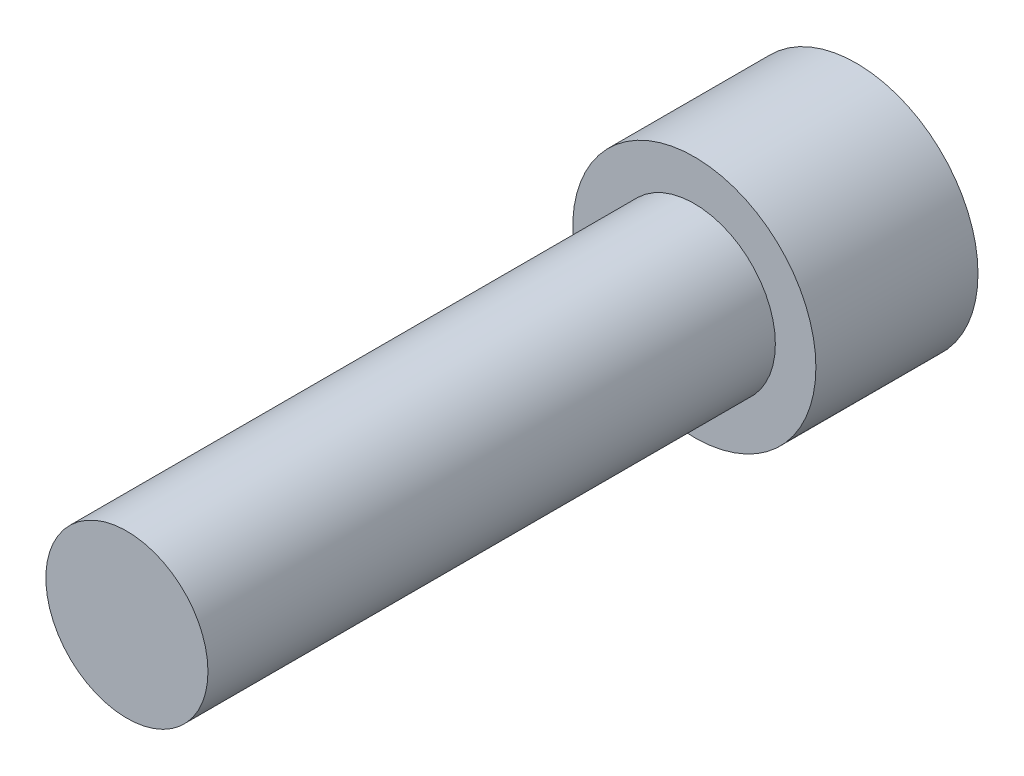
ISO-10303-21;
HEADER;
FILE_DESCRIPTION(('STEP AP214'),'2;1');
FILE_NAME('part.step','',(''),(''),'','','');
FILE_SCHEMA(('AUTOMOTIVE_DESIGN { 1 0 10303 214 1 1 1 1 }'));
ENDSEC;
DATA;
#1=APPLICATION_CONTEXT('core data for automotive mechanical design processes');
#2=APPLICATION_PROTOCOL_DEFINITION('international standard','automotive_design',2000,#1);
#3=PRODUCT_CONTEXT('',#1,'mechanical');
#4=PRODUCT('Part','Part','',(#3));
#5=PRODUCT_RELATED_PRODUCT_CATEGORY('part','',(#4));
#6=PRODUCT_DEFINITION_FORMATION('','',#4);
#7=PRODUCT_DEFINITION_CONTEXT('part definition',#1,'design');
#8=PRODUCT_DEFINITION('design','',#6,#7);
#9=PRODUCT_DEFINITION_SHAPE('','',#8);
#10=(LENGTH_UNIT() NAMED_UNIT(*) SI_UNIT(.MILLI.,.METRE.));
#11=(NAMED_UNIT(*) PLANE_ANGLE_UNIT() SI_UNIT($,.RADIAN.));
#12=(NAMED_UNIT(*) SI_UNIT($,.STERADIAN.) SOLID_ANGLE_UNIT());
#13=UNCERTAINTY_MEASURE_WITH_UNIT(LENGTH_MEASURE(1.E-05),#10,'distance_accuracy_value','');
#14=(GEOMETRIC_REPRESENTATION_CONTEXT(3) GLOBAL_UNCERTAINTY_ASSIGNED_CONTEXT((#13)) GLOBAL_UNIT_ASSIGNED_CONTEXT((#10,
#11,#12)) REPRESENTATION_CONTEXT('',''));
#15=CARTESIAN_POINT('',(0.,0.,0.));
#16=DIRECTION('',(0.,0.,1.));
#17=DIRECTION('',(1.,0.,0.));
#18=AXIS2_PLACEMENT_3D('',#15,#16,#17);
#19=CARTESIAN_POINT('',(0.,-4.7625,-6.35));
#20=DIRECTION('',(0.,0.,-1.));
#21=DIRECTION('',(-1.,0.,0.));
#22=AXIS2_PLACEMENT_3D('',#19,#20,#21);
#23=PLANE('',#22);
#24=DIRECTION('',(0.866025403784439,-0.5,0.));
#25=VECTOR('',#24,1.);
#26=CARTESIAN_POINT('',(0.,2.7569630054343,-6.35));
#27=LINE('',#26,#25);
#28=CARTESIAN_POINT('',(0.,2.7569630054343,-6.35));
#29=VERTEX_POINT('',#28);
#30=CARTESIAN_POINT('',(2.3876,1.37848150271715,-6.35));
#31=VERTEX_POINT('',#30);
#32=EDGE_CURVE('E47',#29,#31,#27,.T.);
#33=ORIENTED_EDGE('',*,*,#32,.F.);
#34=DIRECTION('',(0.866025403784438,0.5,0.));
#35=VECTOR('',#34,1.);
#36=CARTESIAN_POINT('',(-2.3876,1.37848150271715,-6.35));
#37=LINE('',#36,#35);
#38=CARTESIAN_POINT('',(-2.3876,1.37848150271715,-6.35));
#39=VERTEX_POINT('',#38);
#40=EDGE_CURVE('E130',#39,#29,#37,.T.);
#41=ORIENTED_EDGE('',*,*,#40,.F.);
#42=DIRECTION('',(0.,1.,0.));
#43=VECTOR('',#42,1.);
#44=CARTESIAN_POINT('',(-2.3876,-1.37848150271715,-6.35));
#45=LINE('',#44,#43);
#46=CARTESIAN_POINT('',(-2.3876,-1.37848150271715,-6.35));
#47=VERTEX_POINT('',#46);
#48=EDGE_CURVE('E128',#47,#39,#45,.T.);
#49=ORIENTED_EDGE('',*,*,#48,.F.);
#50=DIRECTION('',(-0.866025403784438,0.5,0.));
#51=VECTOR('',#50,1.);
#52=CARTESIAN_POINT('',(0.,-2.7569630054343,-6.35));
#53=LINE('',#52,#51);
#54=CARTESIAN_POINT('',(0.,-2.7569630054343,-6.35));
#55=VERTEX_POINT('',#54);
#56=EDGE_CURVE('E95',#55,#47,#53,.T.);
#57=ORIENTED_EDGE('',*,*,#56,.F.);
#58=DIRECTION('',(-0.866025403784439,-0.5,0.));
#59=VECTOR('',#58,1.);
#60=CARTESIAN_POINT('',(2.3876,-1.37848150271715,-6.35));
#61=LINE('',#60,#59);
#62=CARTESIAN_POINT('',(2.3876,-1.37848150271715,-6.35));
#63=VERTEX_POINT('',#62);
#64=EDGE_CURVE('E124',#63,#55,#61,.T.);
#65=ORIENTED_EDGE('',*,*,#64,.F.);
#66=DIRECTION('',(0.,-1.,0.));
#67=VECTOR('',#66,1.);
#68=CARTESIAN_POINT('',(2.3876,1.37848150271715,-6.35));
#69=LINE('',#68,#67);
#70=EDGE_CURVE('E121',#31,#63,#69,.T.);
#71=ORIENTED_EDGE('',*,*,#70,.F.);
#72=EDGE_LOOP('',(#33,#41,#49,#57,#65,#71));
#73=FACE_BOUND('',#72,.T.);
#74=CARTESIAN_POINT('',(0.,0.,-6.35));
#75=DIRECTION('',(0.,0.,1.));
#76=DIRECTION('',(1.,0.,0.));
#77=AXIS2_PLACEMENT_3D('',#74,#75,#76);
#78=CIRCLE('',#77,4.7625);
#79=CARTESIAN_POINT('',(4.7625,0.,-6.35));
#80=VERTEX_POINT('',#79);
#81=EDGE_CURVE('E11',#80,#80,#78,.T.);
#82=ORIENTED_EDGE('',*,*,#81,.F.);
#83=EDGE_LOOP('',(#82));
#84=FACE_BOUND('',#83,.T.);
#85=ADVANCED_FACE('F33',(#73,#84),#23,.T.);
#86=CARTESIAN_POINT('',(0.,0.,22.225));
#87=DIRECTION('',(0.,0.,1.));
#88=DIRECTION('',(1.,0.,0.));
#89=AXIS2_PLACEMENT_3D('',#86,#87,#88);
#90=CYLINDRICAL_SURFACE('',#89,4.7625);
#91=ORIENTED_EDGE('',*,*,#81,.T.);
#92=EDGE_LOOP('',(#91));
#93=FACE_BOUND('',#92,.T.);
#94=CARTESIAN_POINT('',(0.,0.,0.));
#95=DIRECTION('',(0.,0.,1.));
#96=DIRECTION('',(1.,0.,0.));
#97=AXIS2_PLACEMENT_3D('',#94,#95,#96);
#98=CIRCLE('',#97,4.7625);
#99=CARTESIAN_POINT('',(4.7625,0.,0.));
#100=VERTEX_POINT('',#99);
#101=EDGE_CURVE('E40',#100,#100,#98,.T.);
#102=ORIENTED_EDGE('',*,*,#101,.F.);
#103=EDGE_LOOP('',(#102));
#104=FACE_BOUND('',#103,.T.);
#105=ADVANCED_FACE('F150',(#93,#104),#90,.T.);
#106=CARTESIAN_POINT('',(0.,-3.175,0.));
#107=DIRECTION('',(0.,0.,1.));
#108=DIRECTION('',(1.,0.,0.));
#109=AXIS2_PLACEMENT_3D('',#106,#107,#108);
#110=PLANE('',#109);
#111=ORIENTED_EDGE('',*,*,#101,.T.);
#112=EDGE_LOOP('',(#111));
#113=FACE_BOUND('',#112,.T.);
#114=CARTESIAN_POINT('',(0.,0.,0.));
#115=DIRECTION('',(0.,0.,1.));
#116=DIRECTION('',(1.,0.,0.));
#117=AXIS2_PLACEMENT_3D('',#114,#115,#116);
#118=CIRCLE('',#117,3.175);
#119=CARTESIAN_POINT('',(3.175,0.,0.));
#120=VERTEX_POINT('',#119);
#121=EDGE_CURVE('E142',#120,#120,#118,.T.);
#122=ORIENTED_EDGE('',*,*,#121,.F.);
#123=EDGE_LOOP('',(#122));
#124=FACE_BOUND('',#123,.T.);
#125=ADVANCED_FACE('F147',(#113,#124),#110,.T.);
#126=CARTESIAN_POINT('',(0.,0.,22.225));
#127=DIRECTION('',(0.,0.,1.));
#128=DIRECTION('',(1.,0.,0.));
#129=AXIS2_PLACEMENT_3D('',#126,#127,#128);
#130=CYLINDRICAL_SURFACE('',#129,3.175);
#131=ORIENTED_EDGE('',*,*,#121,.T.);
#132=EDGE_LOOP('',(#131));
#133=FACE_BOUND('',#132,.T.);
#134=CARTESIAN_POINT('',(0.,0.,22.225));
#135=DIRECTION('',(0.,0.,1.));
#136=DIRECTION('',(1.,0.,0.));
#137=AXIS2_PLACEMENT_3D('',#134,#135,#136);
#138=CIRCLE('',#137,3.175);
#139=CARTESIAN_POINT('',(3.175,0.,22.225));
#140=VERTEX_POINT('',#139);
#141=EDGE_CURVE('E134',#140,#140,#138,.T.);
#142=ORIENTED_EDGE('',*,*,#141,.F.);
#143=EDGE_LOOP('',(#142));
#144=FACE_BOUND('',#143,.T.);
#145=ADVANCED_FACE('F157',(#133,#144),#130,.T.);
#146=CARTESIAN_POINT('',(0.,0.,22.225));
#147=DIRECTION('',(0.,0.,1.));
#148=DIRECTION('',(1.,0.,0.));
#149=AXIS2_PLACEMENT_3D('',#146,#147,#148);
#150=PLANE('',#149);
#151=ORIENTED_EDGE('',*,*,#141,.T.);
#152=EDGE_LOOP('',(#151));
#153=FACE_BOUND('',#152,.T.);
#154=ADVANCED_FACE('F163',(#153),#150,.T.);
#155=CARTESIAN_POINT('',(0.,2.7569630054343,-2.794));
#156=DIRECTION('',(0.5,0.866025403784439,0.));
#157=DIRECTION('',(-0.866025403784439,0.5,0.));
#158=AXIS2_PLACEMENT_3D('',#155,#156,#157);
#159=PLANE('',#158);
#160=ORIENTED_EDGE('',*,*,#32,.T.);
#161=DIRECTION('',(0.,0.,-1.));
#162=VECTOR('',#161,1.);
#163=CARTESIAN_POINT('',(2.3876,1.37848150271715,-2.794));
#164=LINE('',#163,#162);
#165=CARTESIAN_POINT('',(2.3876,1.37848150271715,-2.794));
#166=VERTEX_POINT('',#165);
#167=EDGE_CURVE('E77',#166,#31,#164,.T.);
#168=ORIENTED_EDGE('',*,*,#167,.F.);
#169=DIRECTION('',(0.866025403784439,-0.5,0.));
#170=VECTOR('',#169,1.);
#171=CARTESIAN_POINT('',(0.,2.7569630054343,-2.794));
#172=LINE('',#171,#170);
#173=CARTESIAN_POINT('',(0.,2.7569630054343,-2.794));
#174=VERTEX_POINT('',#173);
#175=EDGE_CURVE('E132',#174,#166,#172,.T.);
#176=ORIENTED_EDGE('',*,*,#175,.F.);
#177=DIRECTION('',(0.,0.,-1.));
#178=VECTOR('',#177,1.);
#179=CARTESIAN_POINT('',(0.,2.7569630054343,-2.794));
#180=LINE('',#179,#178);
#181=EDGE_CURVE('E55',#174,#29,#180,.T.);
#182=ORIENTED_EDGE('',*,*,#181,.T.);
#183=EDGE_LOOP('',(#160,#168,#176,#182));
#184=FACE_BOUND('',#183,.T.);
#185=ADVANCED_FACE('F167',(#184),#159,.F.);
#186=CARTESIAN_POINT('',(-2.3876,1.37848150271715,-2.794));
#187=DIRECTION('',(-0.5,0.866025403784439,0.));
#188=DIRECTION('',(-0.866025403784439,-0.5,0.));
#189=AXIS2_PLACEMENT_3D('',#186,#187,#188);
#190=PLANE('',#189);
#191=ORIENTED_EDGE('',*,*,#40,.T.);
#192=ORIENTED_EDGE('',*,*,#181,.F.);
#193=DIRECTION('',(0.866025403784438,0.5,0.));
#194=VECTOR('',#193,1.);
#195=CARTESIAN_POINT('',(-2.3876,1.37848150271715,-2.794));
#196=LINE('',#195,#194);
#197=CARTESIAN_POINT('',(-2.3876,1.37848150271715,-2.794));
#198=VERTEX_POINT('',#197);
#199=EDGE_CURVE('E107',#198,#174,#196,.T.);
#200=ORIENTED_EDGE('',*,*,#199,.F.);
#201=DIRECTION('',(0.,0.,-1.));
#202=VECTOR('',#201,1.);
#203=CARTESIAN_POINT('',(-2.3876,1.37848150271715,-2.794));
#204=LINE('',#203,#202);
#205=EDGE_CURVE('E99',#198,#39,#204,.T.);
#206=ORIENTED_EDGE('',*,*,#205,.T.);
#207=EDGE_LOOP('',(#191,#192,#200,#206));
#208=FACE_BOUND('',#207,.T.);
#209=ADVANCED_FACE('F171',(#208),#190,.F.);
#210=CARTESIAN_POINT('',(-2.3876,-1.37848150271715,-2.794));
#211=DIRECTION('',(-1.,0.,0.));
#212=DIRECTION('',(0.,0.,1.));
#213=AXIS2_PLACEMENT_3D('',#210,#211,#212);
#214=PLANE('',#213);
#215=ORIENTED_EDGE('',*,*,#48,.T.);
#216=ORIENTED_EDGE('',*,*,#205,.F.);
#217=DIRECTION('',(0.,1.,0.));
#218=VECTOR('',#217,1.);
#219=CARTESIAN_POINT('',(-2.3876,-1.37848150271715,-2.794));
#220=LINE('',#219,#218);
#221=CARTESIAN_POINT('',(-2.3876,-1.37848150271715,-2.794));
#222=VERTEX_POINT('',#221);
#223=EDGE_CURVE('E103',#222,#198,#220,.T.);
#224=ORIENTED_EDGE('',*,*,#223,.F.);
#225=DIRECTION('',(0.,0.,-1.));
#226=VECTOR('',#225,1.);
#227=CARTESIAN_POINT('',(-2.3876,-1.37848150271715,-2.794));
#228=LINE('',#227,#226);
#229=EDGE_CURVE('E88',#222,#47,#228,.T.);
#230=ORIENTED_EDGE('',*,*,#229,.T.);
#231=EDGE_LOOP('',(#215,#216,#224,#230));
#232=FACE_BOUND('',#231,.T.);
#233=ADVANCED_FACE('F104',(#232),#214,.F.);
#234=CARTESIAN_POINT('',(0.,-2.7569630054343,-2.794));
#235=DIRECTION('',(-0.5,-0.866025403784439,0.));
#236=DIRECTION('',(0.866025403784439,-0.5,0.));
#237=AXIS2_PLACEMENT_3D('',#234,#235,#236);
#238=PLANE('',#237);
#239=ORIENTED_EDGE('',*,*,#56,.T.);
#240=ORIENTED_EDGE('',*,*,#229,.F.);
#241=DIRECTION('',(-0.866025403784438,0.5,0.));
#242=VECTOR('',#241,1.);
#243=CARTESIAN_POINT('',(0.,-2.7569630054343,-2.794));
#244=LINE('',#243,#242);
#245=CARTESIAN_POINT('',(0.,-2.7569630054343,-2.794));
#246=VERTEX_POINT('',#245);
#247=EDGE_CURVE('E92',#246,#222,#244,.T.);
#248=ORIENTED_EDGE('',*,*,#247,.F.);
#249=DIRECTION('',(0.,0.,-1.));
#250=VECTOR('',#249,1.);
#251=CARTESIAN_POINT('',(0.,-2.7569630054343,-2.794));
#252=LINE('',#251,#250);
#253=EDGE_CURVE('E100',#246,#55,#252,.T.);
#254=ORIENTED_EDGE('',*,*,#253,.T.);
#255=EDGE_LOOP('',(#239,#240,#248,#254));
#256=FACE_BOUND('',#255,.T.);
#257=ADVANCED_FACE('F90',(#256),#238,.F.);
#258=CARTESIAN_POINT('',(2.3876,-1.37848150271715,-2.794));
#259=DIRECTION('',(0.5,-0.866025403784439,0.));
#260=DIRECTION('',(0.866025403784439,0.5,0.));
#261=AXIS2_PLACEMENT_3D('',#258,#259,#260);
#262=PLANE('',#261);
#263=ORIENTED_EDGE('',*,*,#64,.T.);
#264=ORIENTED_EDGE('',*,*,#253,.F.);
#265=DIRECTION('',(-0.866025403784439,-0.5,0.));
#266=VECTOR('',#265,1.);
#267=CARTESIAN_POINT('',(2.3876,-1.37848150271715,-2.794));
#268=LINE('',#267,#266);
#269=CARTESIAN_POINT('',(2.3876,-1.37848150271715,-2.794));
#270=VERTEX_POINT('',#269);
#271=EDGE_CURVE('E113',#270,#246,#268,.T.);
#272=ORIENTED_EDGE('',*,*,#271,.F.);
#273=DIRECTION('',(0.,0.,-1.));
#274=VECTOR('',#273,1.);
#275=CARTESIAN_POINT('',(2.3876,-1.37848150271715,-2.794));
#276=LINE('',#275,#274);
#277=EDGE_CURVE('E137',#270,#63,#276,.T.);
#278=ORIENTED_EDGE('',*,*,#277,.T.);
#279=EDGE_LOOP('',(#263,#264,#272,#278));
#280=FACE_BOUND('',#279,.T.);
#281=ADVANCED_FACE('F175',(#280),#262,.F.);
#282=CARTESIAN_POINT('',(2.3876,1.37848150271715,-2.794));
#283=DIRECTION('',(1.,0.,0.));
#284=DIRECTION('',(0.,0.,-1.));
#285=AXIS2_PLACEMENT_3D('',#282,#283,#284);
#286=PLANE('',#285);
#287=ORIENTED_EDGE('',*,*,#70,.T.);
#288=ORIENTED_EDGE('',*,*,#277,.F.);
#289=DIRECTION('',(0.,-1.,0.));
#290=VECTOR('',#289,1.);
#291=CARTESIAN_POINT('',(2.3876,1.37848150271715,-2.794));
#292=LINE('',#291,#290);
#293=EDGE_CURVE('E115',#166,#270,#292,.T.);
#294=ORIENTED_EDGE('',*,*,#293,.F.);
#295=ORIENTED_EDGE('',*,*,#167,.T.);
#296=EDGE_LOOP('',(#287,#288,#294,#295));
#297=FACE_BOUND('',#296,.T.);
#298=ADVANCED_FACE('F172',(#297),#286,.F.);
#299=CARTESIAN_POINT('',(0.,2.7569630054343,-2.794));
#300=DIRECTION('',(0.,0.,1.));
#301=DIRECTION('',(1.,0.,0.));
#302=AXIS2_PLACEMENT_3D('',#299,#300,#301);
#303=PLANE('',#302);
#304=ORIENTED_EDGE('',*,*,#175,.T.);
#305=ORIENTED_EDGE('',*,*,#293,.T.);
#306=ORIENTED_EDGE('',*,*,#271,.T.);
#307=ORIENTED_EDGE('',*,*,#247,.T.);
#308=ORIENTED_EDGE('',*,*,#223,.T.);
#309=ORIENTED_EDGE('',*,*,#199,.T.);
#310=EDGE_LOOP('',(#304,#305,#306,#307,#308,#309));
#311=FACE_BOUND('',#310,.T.);
#312=ADVANCED_FACE('F110',(#311),#303,.F.);
#313=CLOSED_SHELL('',(#85,#105,#125,#145,#154,#185,#209,#233,#257,#281,#298,#312));
#314=MANIFOLD_SOLID_BREP('B2',#313);
#315=ADVANCED_BREP_SHAPE_REPRESENTATION('',(#18,#314),#14);
#316=SHAPE_DEFINITION_REPRESENTATION(#9,#315);
ENDSEC;
END-ISO-10303-21;
